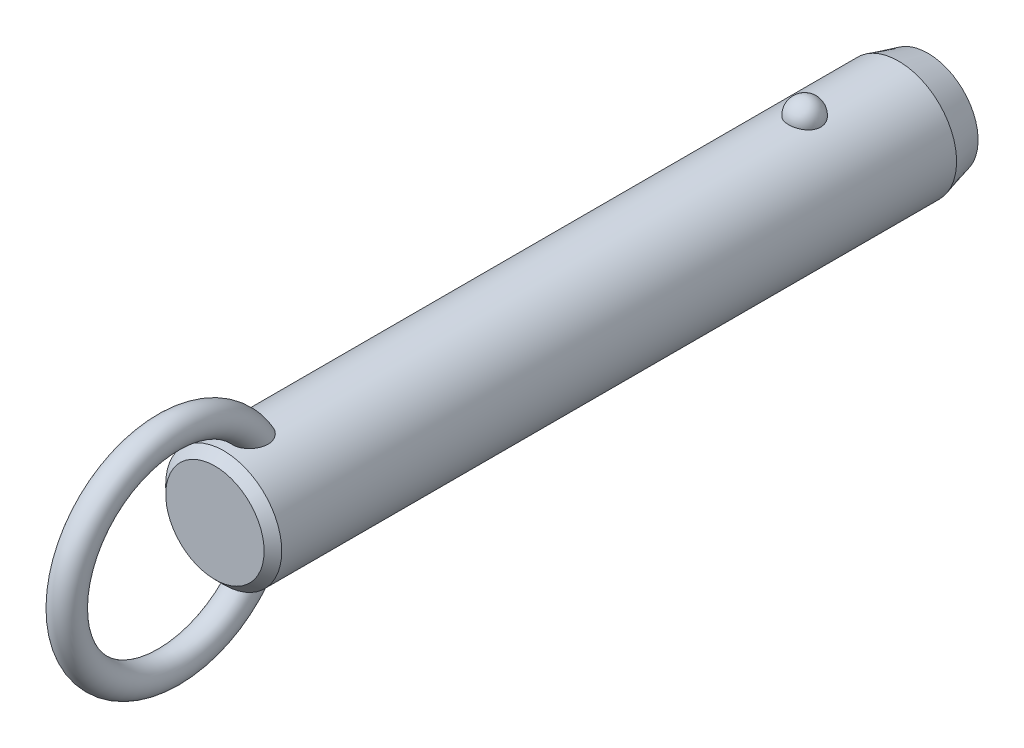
ISO-10303-21;
HEADER;
FILE_DESCRIPTION(('STEP AP214'),'2;1');
FILE_NAME('part.step','',(''),(''),'','','');
FILE_SCHEMA(('AUTOMOTIVE_DESIGN { 1 0 10303 214 1 1 1 1 }'));
ENDSEC;
DATA;
#1=APPLICATION_CONTEXT('core data for automotive mechanical design processes');
#2=APPLICATION_PROTOCOL_DEFINITION('international standard','automotive_design',2000,#1);
#3=PRODUCT_CONTEXT('',#1,'mechanical');
#4=PRODUCT('Part','Part','',(#3));
#5=PRODUCT_RELATED_PRODUCT_CATEGORY('part','',(#4));
#6=PRODUCT_DEFINITION_FORMATION('','',#4);
#7=PRODUCT_DEFINITION_CONTEXT('part definition',#1,'design');
#8=PRODUCT_DEFINITION('design','',#6,#7);
#9=PRODUCT_DEFINITION_SHAPE('','',#8);
#10=(LENGTH_UNIT() NAMED_UNIT(*) SI_UNIT(.MILLI.,.METRE.));
#11=(NAMED_UNIT(*) PLANE_ANGLE_UNIT() SI_UNIT($,.RADIAN.));
#12=(NAMED_UNIT(*) SI_UNIT($,.STERADIAN.) SOLID_ANGLE_UNIT());
#13=UNCERTAINTY_MEASURE_WITH_UNIT(LENGTH_MEASURE(1.E-05),#10,'distance_accuracy_value','');
#14=(GEOMETRIC_REPRESENTATION_CONTEXT(3) GLOBAL_UNCERTAINTY_ASSIGNED_CONTEXT((#13)) GLOBAL_UNIT_ASSIGNED_CONTEXT((#10,
#11,#12)) REPRESENTATION_CONTEXT('',''));
#15=CARTESIAN_POINT('',(0.,0.,0.));
#16=DIRECTION('',(0.,0.,1.));
#17=DIRECTION('',(1.,0.,0.));
#18=AXIS2_PLACEMENT_3D('',#15,#16,#17);
#19=CARTESIAN_POINT('',(0.,0.,68.6));
#20=DIRECTION('',(0.,0.,-1.));
#21=DIRECTION('',(-1.,0.,0.));
#22=AXIS2_PLACEMENT_3D('',#19,#20,#21);
#23=CYLINDRICAL_SURFACE('',#22,7.9);
#24=CARTESIAN_POINT('',(2.1785689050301,7.59367088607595,-2.19999999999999));
#25=CARTESIAN_POINT('',(2.17856679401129,7.59367269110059,-2.07701843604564));
#26=CARTESIAN_POINT('',(2.16853481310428,7.59657145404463,-1.95401006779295));
#27=CARTESIAN_POINT('',(2.12864689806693,7.607843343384,-1.71147811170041));
#28=CARTESIAN_POINT('',(2.09878338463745,7.61621856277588,-1.59195587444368));
#29=CARTESIAN_POINT('',(2.0199931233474,7.63749180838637,-1.3598563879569));
#30=CARTESIAN_POINT('',(1.97107475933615,7.6503878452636,-1.24727610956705));
#31=CARTESIAN_POINT('',(1.85539377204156,7.67926115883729,-1.03213234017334));
#32=CARTESIAN_POINT('',(1.78863158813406,7.69523835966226,-0.929568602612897));
#33=CARTESIAN_POINT('',(1.63856494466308,7.7285848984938,-0.736786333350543));
#34=CARTESIAN_POINT('',(1.55518140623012,7.7459606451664,-0.646630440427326));
#35=CARTESIAN_POINT('',(1.37422937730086,7.78009978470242,-0.481747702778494));
#36=CARTESIAN_POINT('',(1.27666086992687,7.79686317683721,-0.407020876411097));
#37=CARTESIAN_POINT('',(1.07024728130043,7.82786153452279,-0.275278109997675));
#38=CARTESIAN_POINT('',(0.961434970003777,7.84210353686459,-0.218212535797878));
#39=CARTESIAN_POINT('',(0.735351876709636,7.86652194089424,-0.123146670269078));
#40=CARTESIAN_POINT('',(0.618082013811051,7.87669878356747,-0.085144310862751));
#41=CARTESIAN_POINT('',(0.380637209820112,7.89170521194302,-0.0298158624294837));
#42=CARTESIAN_POINT('',(0.260550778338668,7.89662650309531,-0.0121347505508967));
#43=CARTESIAN_POINT('',(0.0190117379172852,7.90090003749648,0.00324379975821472));
#44=CARTESIAN_POINT('',(-0.102440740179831,7.90025280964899,0.00094313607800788));
#45=CARTESIAN_POINT('',(-0.341452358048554,7.89351056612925,-0.0233955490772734));
#46=CARTESIAN_POINT('',(-0.459042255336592,7.88749257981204,-0.0451545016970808));
#47=CARTESIAN_POINT('',(-0.688796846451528,7.87075812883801,-0.107408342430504));
#48=CARTESIAN_POINT('',(-0.800961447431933,7.86004158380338,-0.147903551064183));
#49=CARTESIAN_POINT('',(-1.01743634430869,7.83497131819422,-0.246799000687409));
#50=CARTESIAN_POINT('',(-1.12169791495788,7.82059709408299,-0.305300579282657));
#51=CARTESIAN_POINT('',(-1.31891765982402,7.78976470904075,-0.438549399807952));
#52=CARTESIAN_POINT('',(-1.41187469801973,7.77330633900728,-0.513298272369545));
#53=CARTESIAN_POINT('',(-1.58577142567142,7.73972434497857,-0.678622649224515));
#54=CARTESIAN_POINT('',(-1.66645140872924,7.72259402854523,-0.769470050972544));
#55=CARTESIAN_POINT('',(-1.81161503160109,7.68983776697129,-0.963538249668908));
#56=CARTESIAN_POINT('',(-1.87609753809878,7.6742119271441,-1.06675991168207));
#57=CARTESIAN_POINT('',(-1.98790138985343,7.6460202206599,-1.28401170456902));
#58=CARTESIAN_POINT('',(-2.03501994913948,7.63349104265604,-1.39815107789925));
#59=CARTESIAN_POINT('',(-2.10986724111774,7.6131449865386,-1.63301784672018));
#60=CARTESIAN_POINT('',(-2.1375965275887,7.60532797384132,-1.75374505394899));
#61=CARTESIAN_POINT('',(-2.17289256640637,7.5953195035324,-1.99782562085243));
#62=CARTESIAN_POINT('',(-2.18054294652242,7.59310471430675,-2.12116592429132));
#63=CARTESIAN_POINT('',(-2.17572919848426,7.59448538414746,-2.36741799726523));
#64=CARTESIAN_POINT('',(-2.1632656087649,7.59808068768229,-2.49032977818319));
#65=CARTESIAN_POINT('',(-2.11865035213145,7.61064035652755,-2.73161015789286));
#66=CARTESIAN_POINT('',(-2.08659579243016,7.61957823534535,-2.84999812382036));
#67=CARTESIAN_POINT('',(-2.00367799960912,7.64179982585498,-3.07955956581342));
#68=CARTESIAN_POINT('',(-1.9528140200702,7.65508371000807,-3.19073275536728));
#69=CARTESIAN_POINT('',(-1.83321113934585,7.68460381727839,-3.40337899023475));
#70=CARTESIAN_POINT('',(-1.76437735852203,7.70085556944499,-3.50479651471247));
#71=CARTESIAN_POINT('',(-1.61069526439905,7.73445734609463,-3.69446912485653));
#72=CARTESIAN_POINT('',(-1.52584634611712,7.75180741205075,-3.78272371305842));
#73=CARTESIAN_POINT('',(-1.34198059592,7.78574608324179,-3.94393987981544));
#74=CARTESIAN_POINT('',(-1.24291308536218,7.80233167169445,-4.01684434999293));
#75=CARTESIAN_POINT('',(-1.03352039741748,7.83281625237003,-4.14489386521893));
#76=CARTESIAN_POINT('',(-0.92319600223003,7.84671543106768,-4.20004014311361));
#77=CARTESIAN_POINT('',(-0.695822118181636,7.87011575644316,-4.29042017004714));
#78=CARTESIAN_POINT('',(-0.578872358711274,7.87966903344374,-4.32589112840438));
#79=CARTESIAN_POINT('',(-0.340410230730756,7.8935652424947,-4.37692226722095));
#80=CARTESIAN_POINT('',(-0.218898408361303,7.89790879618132,-4.39248482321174));
#81=CARTESIAN_POINT('',(0.0228107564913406,7.90087453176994,-4.40314405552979));
#82=CARTESIAN_POINT('',(0.142990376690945,7.89960185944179,-4.39861683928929));
#83=CARTESIAN_POINT('',(0.380829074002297,7.89171262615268,-4.37008293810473));
#84=CARTESIAN_POINT('',(0.498488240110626,7.8850962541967,-4.34607694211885));
#85=CARTESIAN_POINT('',(0.727535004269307,7.86726442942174,-4.27939317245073));
#86=CARTESIAN_POINT('',(0.838944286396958,7.85606616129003,-4.236785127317));
#87=CARTESIAN_POINT('',(1.05295421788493,7.83025654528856,-4.13408348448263));
#88=CARTESIAN_POINT('',(1.15555431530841,7.81564498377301,-4.07398879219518));
#89=CARTESIAN_POINT('',(1.35076763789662,7.7843022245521,-3.93687432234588));
#90=CARTESIAN_POINT('',(1.4432046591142,7.76754209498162,-3.85961036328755));
#91=CARTESIAN_POINT('',(1.6139111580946,7.73387857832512,-3.69076949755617));
#92=CARTESIAN_POINT('',(1.6921781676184,7.71697516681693,-3.59919010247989));
#93=CARTESIAN_POINT('',(1.83380875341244,7.6845643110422,-3.40247278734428));
#94=CARTESIAN_POINT('',(1.89689280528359,7.66908588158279,-3.29712873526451));
#95=CARTESIAN_POINT('',(2.0047823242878,7.64159441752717,-3.07707931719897));
#96=CARTESIAN_POINT('',(2.0495945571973,7.62958010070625,-2.96237743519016));
#97=CARTESIAN_POINT('',(2.11580183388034,7.61146617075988,-2.74040519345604));
#98=CARTESIAN_POINT('',(2.13929812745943,7.60484503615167,-2.63379846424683));
#99=CARTESIAN_POINT('',(2.17068242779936,7.59594664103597,-2.41813481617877));
#100=CARTESIAN_POINT('',(2.17857077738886,7.59366928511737,-2.30907795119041));
#101=CARTESIAN_POINT('',(2.1785689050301,7.59367088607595,-2.19999999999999));
#102=B_SPLINE_CURVE_WITH_KNOTS('',3,(#24,#25,#26,#27,#28,#29,#30,#31,#32,#33,#34,#35,#36,#37,
#38,#39,#40,#41,#42,#43,#44,#45,#46,#47,#48,#49,#50,#51,#52,#53,#54,#55,#56,#57,#58,#59,#60,#61,
#62,#63,#64,#65,#66,#67,#68,#69,#70,#71,#72,#73,#74,#75,#76,#77,#78,#79,#80,#81,#82,#83,#84,#85,
#86,#87,#88,#89,#90,#91,#92,#93,#94,#95,#96,#97,#98,#99,#100,#101),.UNSPECIFIED.,.T.,.F.,(4,2,2,
2,2,2,2,2,2,2,2,2,2,2,2,2,2,2,2,2,2,2,2,2,2,2,2,2,2,2,2,2,2,2,2,2,2,2,4),(0.,0.368552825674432,
0.737246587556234,1.10577831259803,1.4743009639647,1.8446206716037,2.21494081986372,
2.5842105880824,2.95344028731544,3.31611630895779,3.67875788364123,4.03628044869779,
4.39380913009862,4.75338791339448,5.11300280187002,5.47939989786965,5.8458226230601,
6.21639834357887,6.58696347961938,6.95598276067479,7.32499216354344,7.69218715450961,
8.0593967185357,8.42858578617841,8.79778880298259,9.16834203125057,9.5388695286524,
9.90482699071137,10.2707407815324,10.6298333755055,10.9889132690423,11.3466585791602,
11.7044262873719,12.0676511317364,12.4309391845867,12.8004764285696,13.1698767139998,
13.4967701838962,13.8236564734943),.UNSPECIFIED.);
#103=CARTESIAN_POINT('',(2.1785689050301,7.59367088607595,-2.19999999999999));
#104=VERTEX_POINT('',#103);
#105=EDGE_CURVE('E41',#104,#104,#102,.T.);
#106=ORIENTED_EDGE('',*,*,#105,.T.);
#107=EDGE_LOOP('',(#106));
#108=FACE_BOUND('',#107,.T.);
#109=CARTESIAN_POINT('',(0.,0.,76.92));
#110=DIRECTION('',(0.,0.,1.));
#111=DIRECTION('',(1.,0.,0.));
#112=AXIS2_PLACEMENT_3D('',#109,#110,#111);
#113=CIRCLE('',#112,7.9);
#114=CARTESIAN_POINT('',(7.9,0.,76.92));
#115=VERTEX_POINT('',#114);
#116=EDGE_CURVE('E10',#115,#115,#113,.F.);
#117=ORIENTED_EDGE('',*,*,#116,.T.);
#118=EDGE_LOOP('',(#117));
#119=FACE_BOUND('',#118,.T.);
#120=CARTESIAN_POINT('',(-0.630969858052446,-7.87476203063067,70.8124322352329));
#121=CARTESIAN_POINT('',(-0.73418033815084,-7.8664899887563,70.847285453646));
#122=CARTESIAN_POINT('',(-0.834476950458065,-7.85639291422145,70.8908160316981));
#123=CARTESIAN_POINT('',(-1.02620356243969,-7.83366343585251,70.994094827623));
#124=CARTESIAN_POINT('',(-1.1176141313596,-7.82102565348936,71.0538775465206));
#125=CARTESIAN_POINT('',(-1.28877277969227,-7.79464922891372,71.1878390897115));
#126=CARTESIAN_POINT('',(-1.36854014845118,-7.78091246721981,71.261993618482));
#127=CARTESIAN_POINT('',(-1.5146152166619,-7.75380398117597,71.4224941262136));
#128=CARTESIAN_POINT('',(-1.58092966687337,-7.74043207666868,71.5088339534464));
#129=CARTESIAN_POINT('',(-1.70019064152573,-7.71512522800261,71.6929784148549));
#130=CARTESIAN_POINT('',(-1.75284037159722,-7.70322473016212,71.7909792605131));
#131=CARTESIAN_POINT('',(-1.84263464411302,-7.68224112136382,71.9941029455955));
#132=CARTESIAN_POINT('',(-1.87977299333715,-7.6731591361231,72.0992286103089));
#133=CARTESIAN_POINT('',(-1.94152728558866,-7.65777930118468,72.3232849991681));
#134=CARTESIAN_POINT('',(-1.96475471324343,-7.65179654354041,72.4426167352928));
#135=CARTESIAN_POINT('',(-1.99449499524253,-7.64409642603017,72.6834298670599));
#136=CARTESIAN_POINT('',(-2.0010005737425,-7.64238092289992,72.8049121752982));
#137=CARTESIAN_POINT('',(-1.99856014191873,-7.64302120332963,73.0683409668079));
#138=CARTESIAN_POINT('',(-1.98680021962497,-7.64611845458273,73.2102565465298));
#139=CARTESIAN_POINT('',(-1.94457772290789,-7.65696186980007,73.4911188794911));
#140=CARTESIAN_POINT('',(-1.91409393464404,-7.66471330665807,73.6300620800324));
#141=CARTESIAN_POINT('',(-1.82768670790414,-7.68582947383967,73.931939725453));
#142=CARTESIAN_POINT('',(-1.76772963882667,-7.70003779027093,74.093686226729));
#143=CARTESIAN_POINT('',(-1.65998501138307,-7.72371550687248,74.3276956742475));
#144=CARTESIAN_POINT('',(-1.621079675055,-7.73200670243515,74.4042974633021));
#145=CARTESIAN_POINT('',(-1.53727726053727,-7.74910377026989,74.5540798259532));
#146=CARTESIAN_POINT('',(-1.49238215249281,-7.75790947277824,74.6272615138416));
#147=CARTESIAN_POINT('',(-1.3739705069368,-7.77993338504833,74.8028838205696));
#148=CARTESIAN_POINT('',(-1.29690364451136,-7.79328473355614,74.9029557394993));
#149=CARTESIAN_POINT('',(-1.1288548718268,-7.81939266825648,75.0907147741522));
#150=CARTESIAN_POINT('',(-1.03789926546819,-7.83215032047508,75.1784247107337));
#151=CARTESIAN_POINT('',(-0.869532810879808,-7.85231710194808,75.3134148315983));
#152=CARTESIAN_POINT('',(-0.795716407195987,-7.86021093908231,75.365076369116));
#153=CARTESIAN_POINT('',(-0.640813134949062,-7.87434920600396,75.4563815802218));
#154=CARTESIAN_POINT('',(-0.559737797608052,-7.88059619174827,75.4960438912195));
#155=CARTESIAN_POINT('',(-0.406456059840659,-7.88984116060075,75.5543008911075));
#156=CARTESIAN_POINT('',(-0.335227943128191,-7.89321892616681,75.5753848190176));
#157=CARTESIAN_POINT('',(-0.19019307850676,-7.89804235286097,75.6054141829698));
#158=CARTESIAN_POINT('',(-0.11638863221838,-7.89948969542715,75.6143701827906));
#159=CARTESIAN_POINT('',(0.0318414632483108,-7.90028409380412,75.6192915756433));
#160=CARTESIAN_POINT('',(0.106268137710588,-7.89962640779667,75.6152276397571));
#161=CARTESIAN_POINT('',(0.253290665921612,-7.8962818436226,75.5944615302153));
#162=CARTESIAN_POINT('',(0.32588518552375,-7.8935935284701,75.5777504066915));
#163=CARTESIAN_POINT('',(0.481441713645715,-7.88577340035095,75.5287380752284));
#164=CARTESIAN_POINT('',(0.563611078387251,-7.88026321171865,75.494005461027));
#165=CARTESIAN_POINT('',(0.721129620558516,-7.86741729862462,75.4117965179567));
#166=CARTESIAN_POINT('',(0.796466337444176,-7.86007832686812,75.364297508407));
#167=CARTESIAN_POINT('',(0.971456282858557,-7.84073285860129,75.236513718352));
#168=CARTESIAN_POINT('',(1.0671968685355,-7.82809461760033,75.1510047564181));
#169=CARTESIAN_POINT('',(1.24418921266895,-7.80192439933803,74.966232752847));
#170=CARTESIAN_POINT('',(1.32540832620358,-7.78839049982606,74.8669395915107));
#171=CARTESIAN_POINT('',(1.45199971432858,-7.76559693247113,74.6895760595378));
#172=CARTESIAN_POINT('',(1.50085649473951,-7.75626094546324,74.6139542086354));
#173=CARTESIAN_POINT('',(1.59197749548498,-7.7380727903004,74.4587428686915));
#174=CARTESIAN_POINT('',(1.63423919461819,-7.72922080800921,74.3791518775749));
#175=CARTESIAN_POINT('',(1.71222612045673,-7.71231959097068,74.2166640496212));
#176=CARTESIAN_POINT('',(1.74794516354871,-7.70427111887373,74.1337641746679));
#177=CARTESIAN_POINT('',(1.81270113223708,-7.68929240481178,73.9652967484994));
#178=CARTESIAN_POINT('',(1.84173789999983,-7.68236218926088,73.8797291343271));
#179=CARTESIAN_POINT('',(1.89322698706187,-7.6698375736,73.7052870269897));
#180=CARTESIAN_POINT('',(1.91558744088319,-7.66426199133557,73.6163838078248));
#181=CARTESIAN_POINT('',(1.95281367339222,-7.65485915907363,73.4369696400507));
#182=CARTESIAN_POINT('',(1.96767946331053,-7.65103190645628,73.3464586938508));
#183=CARTESIAN_POINT('',(2.00021456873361,-7.64262981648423,73.0737320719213));
#184=CARTESIAN_POINT('',(2.00600691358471,-7.6410871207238,72.8897099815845));
#185=CARTESIAN_POINT('',(1.98445334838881,-7.64669564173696,72.5765019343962));
#186=CARTESIAN_POINT('',(1.96607186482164,-7.65149688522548,72.4466189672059));
#187=CARTESIAN_POINT('',(1.90884967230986,-7.6659762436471,72.1916321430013));
#188=CARTESIAN_POINT('',(1.8700210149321,-7.67565148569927,72.066525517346));
#189=CARTESIAN_POINT('',(1.77063986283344,-7.69918471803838,71.8245401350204));
#190=CARTESIAN_POINT('',(1.70993724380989,-7.71307150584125,71.7077250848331));
#191=CARTESIAN_POINT('',(1.5673307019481,-7.74330306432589,71.4881444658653));
#192=CARTESIAN_POINT('',(1.48543692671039,-7.75964665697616,71.3853722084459));
#193=CARTESIAN_POINT('',(1.31346177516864,-7.79047523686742,71.2093800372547));
#194=CARTESIAN_POINT('',(1.22547278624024,-7.80495298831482,71.1341066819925));
#195=CARTESIAN_POINT('',(1.03724352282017,-7.83218597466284,71.0004864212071));
#196=CARTESIAN_POINT('',(0.937008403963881,-7.84494192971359,70.9421324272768));
#197=CARTESIAN_POINT('',(0.733599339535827,-7.86649045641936,70.8470270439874));
#198=CARTESIAN_POINT('',(0.630941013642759,-7.87547134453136,70.8092109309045));
#199=CARTESIAN_POINT('',(0.420465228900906,-7.88950708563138,70.7511160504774));
#200=CARTESIAN_POINT('',(0.312645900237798,-7.89456050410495,70.7308436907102));
#201=CARTESIAN_POINT('',(0.0960869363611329,-7.9001518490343,70.7084559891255));
#202=CARTESIAN_POINT('',(-0.0126341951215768,-7.90073226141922,70.7061698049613));
#203=CARTESIAN_POINT('',(-0.228766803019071,-7.89742350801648,70.7193678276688));
#204=CARTESIAN_POINT('',(-0.336180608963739,-7.89354403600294,70.7348134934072));
#205=CARTESIAN_POINT('',(-0.473410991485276,-7.88586871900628,70.7662177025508));
#206=CARTESIAN_POINT('',(-0.50525779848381,-7.88388984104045,70.7743541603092));
#207=CARTESIAN_POINT('',(-0.5684812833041,-7.87958326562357,70.7922083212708));
#208=CARTESIAN_POINT('',(-0.599857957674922,-7.87725556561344,70.8019260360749));
#209=CARTESIAN_POINT('',(-0.630969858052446,-7.87476203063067,70.8124322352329));
#210=B_SPLINE_CURVE_WITH_KNOTS('',3,(#120,#121,#122,#123,#124,#125,#126,#127,#128,#129,#130,
#131,#132,#133,#134,#135,#136,#137,#138,#139,#140,#141,#142,#143,#144,#145,#146,#147,#148,#149,
#150,#151,#152,#153,#154,#155,#156,#157,#158,#159,#160,#161,#162,#163,#164,#165,#166,#167,#168,
#169,#170,#171,#172,#173,#174,#175,#176,#177,#178,#179,#180,#181,#182,#183,#184,#185,#186,#187,
#188,#189,#190,#191,#192,#193,#194,#195,#196,#197,#198,#199,#200,#201,#202,#203,#204,#205,#206,
#207,#208,#209),.UNSPECIFIED.,.T.,.F.,(4,2,2,2,2,2,2,2,2,2,2,2,2,2,2,2,2,2,2,2,2,2,2,2,2,2,2,2,
2,2,2,2,2,2,2,2,2,2,2,2,2,2,2,2,4),(0.,0.327622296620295,0.655945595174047,0.983718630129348,
1.3113267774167,1.64554655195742,1.9798996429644,2.3436572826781,2.70757317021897,
3.13333684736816,3.55958380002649,4.07655306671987,4.3352789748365,4.59391999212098,
4.97382437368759,5.35301797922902,5.62348245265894,5.89352465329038,6.11565959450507,
6.3376009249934,6.56004255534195,6.78264174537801,7.04930844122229,7.31645206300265,
7.70130871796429,8.08701995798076,8.35824509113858,8.62957365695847,8.90115735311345,
9.17274746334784,9.44791855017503,9.72308922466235,10.2715298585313,10.6638393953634,
11.0559179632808,11.4507403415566,11.845374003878,12.1936425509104,12.5417649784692,
12.8695063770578,13.1973674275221,13.5221104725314,13.8461490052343,13.9449071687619,
14.0436660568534),.UNSPECIFIED.);
#211=CARTESIAN_POINT('',(-0.630969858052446,-7.87476203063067,70.8124322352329));
#212=VERTEX_POINT('',#211);
#213=EDGE_CURVE('E59',#212,#212,#210,.T.);
#214=ORIENTED_EDGE('',*,*,#213,.T.);
#215=EDGE_LOOP('',(#214));
#216=FACE_BOUND('',#215,.T.);
#217=CARTESIAN_POINT('',(-0.630969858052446,7.87476203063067,70.8124322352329));
#218=CARTESIAN_POINT('',(-0.528918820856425,7.88293636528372,70.7779798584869));
#219=CARTESIAN_POINT('',(-0.423745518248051,7.8893481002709,70.751915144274));
#220=CARTESIAN_POINT('',(-0.210236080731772,7.8979273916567,70.7172825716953));
#221=CARTESIAN_POINT('',(-0.10189380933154,7.90008607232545,70.7087513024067));
#222=CARTESIAN_POINT('',(0.114660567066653,7.89990877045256,70.7094570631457));
#223=CARTESIAN_POINT('',(0.222872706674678,7.89757640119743,70.7186798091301));
#224=CARTESIAN_POINT('',(0.436107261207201,7.88867538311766,70.7546525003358));
#225=CARTESIAN_POINT('',(0.541131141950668,7.8821087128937,70.7813942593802));
#226=CARTESIAN_POINT('',(0.745085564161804,7.86545130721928,70.8517561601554));
#227=CARTESIAN_POINT('',(0.844015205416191,7.85536005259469,70.8953787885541));
#228=CARTESIAN_POINT('',(1.03299167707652,7.83275153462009,70.9983796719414));
#229=CARTESIAN_POINT('',(1.12303841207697,7.8202342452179,71.0577580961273));
#230=CARTESIAN_POINT('',(1.29214734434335,7.79408219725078,71.1908647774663));
#231=CARTESIAN_POINT('',(1.37116907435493,7.78044359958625,71.2646436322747));
#232=CARTESIAN_POINT('',(1.51597677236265,7.75353170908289,71.4242353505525));
#233=CARTESIAN_POINT('',(1.58176261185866,7.74025841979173,71.5100483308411));
#234=CARTESIAN_POINT('',(1.70057386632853,7.71504069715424,71.693644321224));
#235=CARTESIAN_POINT('',(1.75320073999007,7.70314257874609,71.7916906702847));
#236=CARTESIAN_POINT('',(1.84293767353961,7.68216822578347,71.9948931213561));
#237=CARTESIAN_POINT('',(1.88004278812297,7.67309289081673,72.1000514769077));
#238=CARTESIAN_POINT('',(1.9417232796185,7.6577294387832,72.3241671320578));
#239=CARTESIAN_POINT('',(1.96491037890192,7.65175648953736,72.4435248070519));
#240=CARTESIAN_POINT('',(1.9945689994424,7.64407702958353,72.6843848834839));
#241=CARTESIAN_POINT('',(2.00103304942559,7.64237242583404,72.8058882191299));
#242=CARTESIAN_POINT('',(1.9985016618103,7.64303650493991,73.0693688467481));
#243=CARTESIAN_POINT('',(1.98669038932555,7.64614714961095,73.2113141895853));
#244=CARTESIAN_POINT('',(1.94436120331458,7.6570170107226,73.4922287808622));
#245=CARTESIAN_POINT('',(1.91382203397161,7.66478150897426,73.6311944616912));
#246=CARTESIAN_POINT('',(1.82728754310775,7.68592483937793,73.9331110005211));
#247=CARTESIAN_POINT('',(1.76725778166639,7.7001468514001,74.094872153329));
#248=CARTESIAN_POINT('',(1.65939700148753,7.72384204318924,74.3288914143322));
#249=CARTESIAN_POINT('',(1.62045187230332,7.73213852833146,74.4054942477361));
#250=CARTESIAN_POINT('',(1.53656684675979,7.74924489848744,74.5552737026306));
#251=CARTESIAN_POINT('',(1.49162892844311,7.75805461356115,74.6284514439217));
#252=CARTESIAN_POINT('',(1.37317698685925,7.78007342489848,74.8039520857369));
#253=CARTESIAN_POINT('',(1.29612360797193,7.79341423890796,74.9039112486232));
#254=CARTESIAN_POINT('',(1.12812043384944,7.81949839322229,75.0914508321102));
#255=CARTESIAN_POINT('',(1.03719688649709,7.83224280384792,75.1790540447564));
#256=CARTESIAN_POINT('',(0.868871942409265,7.85239026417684,75.3138971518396));
#257=CARTESIAN_POINT('',(0.795056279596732,7.86027769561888,75.3655113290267));
#258=CARTESIAN_POINT('',(0.640160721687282,7.87440222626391,75.4567201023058));
#259=CARTESIAN_POINT('',(0.559092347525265,7.88064188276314,75.4963333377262));
#260=CARTESIAN_POINT('',(0.405820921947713,7.8898738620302,75.5545056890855));
#261=CARTESIAN_POINT('',(0.334594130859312,7.89324577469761,75.5755523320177));
#262=CARTESIAN_POINT('',(0.189568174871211,7.89805733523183,75.6055070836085));
#263=CARTESIAN_POINT('',(0.115771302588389,7.89949866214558,75.6144257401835));
#264=CARTESIAN_POINT('',(-0.032435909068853,7.90028156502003,75.6192758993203));
#265=CARTESIAN_POINT('',(-0.106847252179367,7.89961843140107,75.6151782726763));
#266=CARTESIAN_POINT('',(-0.253834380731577,7.8962642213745,75.5943519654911));
#267=CARTESIAN_POINT('',(-0.326408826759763,7.89357170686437,75.5776143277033));
#268=CARTESIAN_POINT('',(-0.481962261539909,7.88574179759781,75.5285391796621));
#269=CARTESIAN_POINT('',(-0.564145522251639,7.88022507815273,75.4937638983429));
#270=CARTESIAN_POINT('',(-0.721685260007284,7.8673664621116,75.4114686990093));
#271=CARTESIAN_POINT('',(-0.797029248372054,7.8600213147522,75.3639260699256));
#272=CARTESIAN_POINT('',(-0.972044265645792,7.84066026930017,75.2360267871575));
#273=CARTESIAN_POINT('',(-1.06779803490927,7.82801274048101,75.1504436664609));
#274=CARTESIAN_POINT('',(-1.24480531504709,7.80182621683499,74.9655223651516));
#275=CARTESIAN_POINT('',(-1.32602618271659,7.78828530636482,74.8661540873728));
#276=CARTESIAN_POINT('',(-1.45259834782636,7.76548487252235,74.6886806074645));
#277=CARTESIAN_POINT('',(-1.50143856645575,7.75614818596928,74.6130252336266));
#278=CARTESIAN_POINT('',(-1.59252410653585,7.73796020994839,74.4577484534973));
#279=CARTESIAN_POINT('',(-1.63476690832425,7.72910910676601,74.3781255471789));
#280=CARTESIAN_POINT('',(-1.71271318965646,7.71221133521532,74.2155750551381));
#281=CARTESIAN_POINT('',(-1.74841047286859,7.70416543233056,74.1326444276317));
#282=CARTESIAN_POINT('',(-1.81311929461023,7.6891937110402,73.9641168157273));
#283=CARTESIAN_POINT('',(-1.84213067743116,7.6822679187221,73.8785197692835));
#284=CARTESIAN_POINT('',(-1.89356259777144,7.66975461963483,73.7040254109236));
#285=CARTESIAN_POINT('',(-1.91589165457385,7.66418586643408,73.6150995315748));
#286=CARTESIAN_POINT('',(-1.95305070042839,7.65479859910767,73.4356424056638));
#287=CARTESIAN_POINT('',(-1.96788069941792,7.65098008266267,73.3451111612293));
#288=CARTESIAN_POINT('',(-2.00030078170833,7.64260704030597,73.0723270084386));
#289=CARTESIAN_POINT('',(-2.00600576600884,7.64108760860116,72.8882718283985));
#290=CARTESIAN_POINT('',(-1.98428483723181,7.64673945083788,72.5750800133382));
#291=CARTESIAN_POINT('',(-1.96583698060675,7.6515575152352,72.4452400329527));
#292=CARTESIAN_POINT('',(-1.90848948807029,7.66606613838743,72.1903619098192));
#293=CARTESIAN_POINT('',(-1.86960376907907,7.67575338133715,72.065320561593));
#294=CARTESIAN_POINT('',(-1.7701342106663,7.69930132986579,71.8235009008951));
#295=CARTESIAN_POINT('',(-1.70940488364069,7.71318991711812,71.7067844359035));
#296=CARTESIAN_POINT('',(-1.56672953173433,7.74342495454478,71.4873404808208));
#297=CARTESIAN_POINT('',(-1.48478316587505,7.75977144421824,71.3846132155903));
#298=CARTESIAN_POINT('',(-1.31266325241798,7.79061163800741,71.208643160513));
#299=CARTESIAN_POINT('',(-1.22456383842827,7.80509908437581,71.1333589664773));
#300=CARTESIAN_POINT('',(-1.03622400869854,7.83231881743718,70.9998659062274));
#301=CARTESIAN_POINT('',(-0.936015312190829,7.84505551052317,70.9416137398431));
#302=CARTESIAN_POINT('',(-0.798824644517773,7.85957802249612,70.8775408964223));
#303=CARTESIAN_POINT('',(-0.765787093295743,7.86286821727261,70.8632248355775));
#304=CARTESIAN_POINT('',(-0.698939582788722,7.86909211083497,70.836436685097));
#305=CARTESIAN_POINT('',(-0.66512963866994,7.8720258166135,70.8239645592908));
#306=CARTESIAN_POINT('',(-0.630969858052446,7.87476203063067,70.8124322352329));
#307=B_SPLINE_CURVE_WITH_KNOTS('',3,(#217,#218,#219,#220,#221,#222,#223,#224,#225,#226,#227,
#228,#229,#230,#231,#232,#233,#234,#235,#236,#237,#238,#239,#240,#241,#242,#243,#244,#245,#246,
#247,#248,#249,#250,#251,#252,#253,#254,#255,#256,#257,#258,#259,#260,#261,#262,#263,#264,#265,
#266,#267,#268,#269,#270,#271,#272,#273,#274,#275,#276,#277,#278,#279,#280,#281,#282,#283,#284,
#285,#286,#287,#288,#289,#290,#291,#292,#293,#294,#295,#296,#297,#298,#299,#300,#301,#302,#303,
#304,#305,#306),.UNSPECIFIED.,.T.,.F.,(4,2,2,2,2,2,2,2,2,2,2,2,2,2,2,2,2,2,2,2,2,2,2,2,2,2,2,2,
2,2,2,2,2,2,2,2,2,2,2,2,2,2,2,2,4),(0.,0.323920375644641,0.648516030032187,0.97285063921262,
1.29703380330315,1.62126473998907,1.94549915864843,2.27089401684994,2.5962920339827,
2.93059633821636,3.26500707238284,3.62881644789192,3.99278833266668,4.41865421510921,
4.84500434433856,5.36209210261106,5.62087589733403,5.87957448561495,6.25918598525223,
6.63808782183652,6.90846748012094,7.17842501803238,7.40052350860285,7.62242871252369,
7.84483086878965,8.06739077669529,8.33414615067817,8.60137921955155,8.98641454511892,
9.3723041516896,9.64358673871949,9.91497268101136,10.1866142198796,10.4582620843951,
10.7334745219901,11.0086865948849,11.5572126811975,11.9494246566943,12.3413699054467,
12.7359755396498,13.1305875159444,13.4791770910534,13.82687259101,13.9353013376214,
14.0437279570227),.UNSPECIFIED.);
#308=CARTESIAN_POINT('',(-0.630969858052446,7.87476203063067,70.8124322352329));
#309=VERTEX_POINT('',#308);
#310=EDGE_CURVE('E67',#309,#309,#307,.T.);
#311=ORIENTED_EDGE('',*,*,#310,.T.);
#312=EDGE_LOOP('',(#311));
#313=FACE_BOUND('',#312,.T.);
#314=CARTESIAN_POINT('',(0.,0.,-15.));
#315=DIRECTION('',(0.,0.,-1.));
#316=DIRECTION('',(-1.,0.,0.));
#317=AXIS2_PLACEMENT_3D('',#314,#315,#316);
#318=CIRCLE('',#317,7.9);
#319=CARTESIAN_POINT('',(-7.9,0.,-15.));
#320=VERTEX_POINT('',#319);
#321=EDGE_CURVE('E56',#320,#320,#318,.F.);
#322=ORIENTED_EDGE('',*,*,#321,.T.);
#323=EDGE_LOOP('',(#322));
#324=FACE_BOUND('',#323,.T.);
#325=ADVANCED_FACE('F37',(#108,#119,#216,#313,#324),#23,.T.);
#326=CARTESIAN_POINT('',(0.,0.,-19.));
#327=DIRECTION('',(0.,0.,-1.));
#328=DIRECTION('',(-1.,0.,0.));
#329=AXIS2_PLACEMENT_3D('',#326,#327,#328);
#330=PLANE('',#329);
#331=CARTESIAN_POINT('',(0.,0.,-19.));
#332=DIRECTION('',(0.,0.,-1.));
#333=DIRECTION('',(-1.,0.,0.));
#334=AXIS2_PLACEMENT_3D('',#331,#332,#333);
#335=CIRCLE('',#334,6.82820323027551);
#336=CARTESIAN_POINT('',(-6.82820323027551,0.,-19.));
#337=VERTEX_POINT('',#336);
#338=EDGE_CURVE('E66',#337,#337,#335,.T.);
#339=ORIENTED_EDGE('',*,*,#338,.T.);
#340=EDGE_LOOP('',(#339));
#341=FACE_BOUND('',#340,.T.);
#342=ADVANCED_FACE('F85',(#341),#330,.T.);
#343=CARTESIAN_POINT('',(0.,0.,-19.));
#344=DIRECTION('',(0.,0.,1.));
#345=DIRECTION('',(1.,0.,0.));
#346=AXIS2_PLACEMENT_3D('',#343,#344,#345);
#347=CONICAL_SURFACE('',#346,6.82820323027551,0.261799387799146);
#348=ORIENTED_EDGE('',*,*,#321,.F.);
#349=EDGE_LOOP('',(#348));
#350=FACE_BOUND('',#349,.T.);
#351=ORIENTED_EDGE('',*,*,#338,.F.);
#352=EDGE_LOOP('',(#351));
#353=FACE_BOUND('',#352,.T.);
#354=ADVANCED_FACE('F83',(#350,#353),#347,.T.);
#355=CARTESIAN_POINT('',(0.,0.,78.12));
#356=DIRECTION('',(0.,0.,1.));
#357=DIRECTION('',(1.,0.,0.));
#358=AXIS2_PLACEMENT_3D('',#355,#356,#357);
#359=PLANE('',#358);
#360=CARTESIAN_POINT('',(0.,0.,78.12));
#361=DIRECTION('',(0.,0.,1.));
#362=DIRECTION('',(1.,0.,0.));
#363=AXIS2_PLACEMENT_3D('',#360,#361,#362);
#364=CIRCLE('',#363,6.70000000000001);
#365=CARTESIAN_POINT('',(6.70000000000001,0.,78.12));
#366=VERTEX_POINT('',#365);
#367=EDGE_CURVE('E50',#366,#366,#364,.T.);
#368=ORIENTED_EDGE('',*,*,#367,.T.);
#369=EDGE_LOOP('',(#368));
#370=FACE_BOUND('',#369,.T.);
#371=ADVANCED_FACE('F77',(#370),#359,.T.);
#372=CARTESIAN_POINT('',(0.,0.,84.45));
#373=DIRECTION('',(1.,0.,0.));
#374=DIRECTION('',(0.,0.,-1.));
#375=AXIS2_PLACEMENT_3D('',#372,#373,#374);
#376=TOROIDAL_SURFACE('',#375,13.85,2.);
#377=ORIENTED_EDGE('',*,*,#310,.F.);
#378=EDGE_LOOP('',(#377));
#379=FACE_BOUND('',#378,.T.);
#380=ORIENTED_EDGE('',*,*,#213,.F.);
#381=EDGE_LOOP('',(#380));
#382=FACE_BOUND('',#381,.T.);
#383=ADVANCED_FACE('F73',(#379,#382),#376,.T.);
#384=CARTESIAN_POINT('',(0.,0.,78.12));
#385=DIRECTION('',(0.,0.,-1.));
#386=DIRECTION('',(-1.,0.,0.));
#387=AXIS2_PLACEMENT_3D('',#384,#385,#386);
#388=CONICAL_SURFACE('',#387,6.70000000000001,0.785398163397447);
#389=ORIENTED_EDGE('',*,*,#116,.F.);
#390=EDGE_LOOP('',(#389));
#391=FACE_BOUND('',#390,.T.);
#392=ORIENTED_EDGE('',*,*,#367,.F.);
#393=EDGE_LOOP('',(#392));
#394=FACE_BOUND('',#393,.T.);
#395=ADVANCED_FACE('F39',(#391,#394),#388,.T.);
#396=CARTESIAN_POINT('',(0.,7.9,-2.19999999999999));
#397=DIRECTION('',(0.,1.,0.));
#398=DIRECTION('',(0.,0.,-1.));
#399=AXIS2_PLACEMENT_3D('',#396,#397,#398);
#400=SPHERICAL_SURFACE('',#399,2.2);
#401=ORIENTED_EDGE('',*,*,#105,.F.);
#402=EDGE_LOOP('',(#401));
#403=FACE_BOUND('',#402,.T.);
#404=ADVANCED_FACE('F79',(#403),#400,.T.);
#405=CLOSED_SHELL('',(#325,#342,#354,#371,#383,#395,#404));
#406=MANIFOLD_SOLID_BREP('B2',#405);
#407=ADVANCED_BREP_SHAPE_REPRESENTATION('',(#18,#406),#14);
#408=SHAPE_DEFINITION_REPRESENTATION(#9,#407);
ENDSEC;
END-ISO-10303-21;
